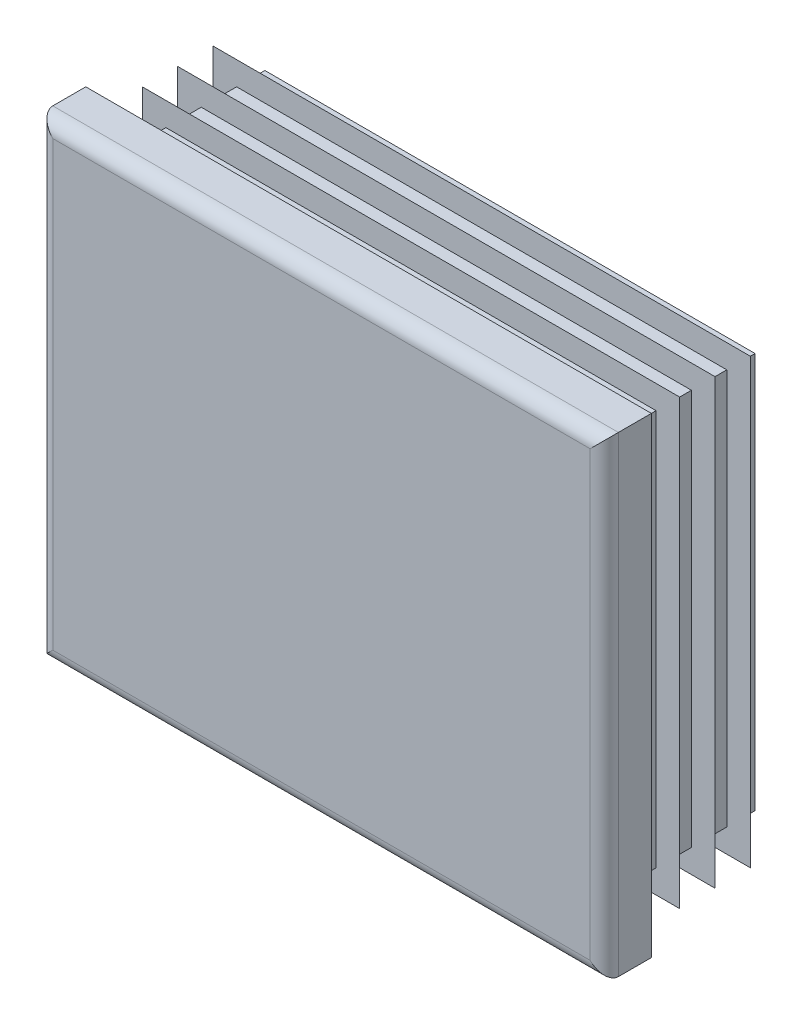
ISO-10303-21;
HEADER;
FILE_DESCRIPTION(('STEP AP214'),'2;1');
FILE_NAME('part.step','',(''),(''),'','','');
FILE_SCHEMA(('AUTOMOTIVE_DESIGN { 1 0 10303 214 1 1 1 1 }'));
ENDSEC;
DATA;
#1=APPLICATION_CONTEXT('core data for automotive mechanical design processes');
#2=APPLICATION_PROTOCOL_DEFINITION('international standard','automotive_design',2000,#1);
#3=PRODUCT_CONTEXT('',#1,'mechanical');
#4=PRODUCT('Part','Part','',(#3));
#5=PRODUCT_RELATED_PRODUCT_CATEGORY('part','',(#4));
#6=PRODUCT_DEFINITION_FORMATION('','',#4);
#7=PRODUCT_DEFINITION_CONTEXT('part definition',#1,'design');
#8=PRODUCT_DEFINITION('design','',#6,#7);
#9=PRODUCT_DEFINITION_SHAPE('','',#8);
#10=(LENGTH_UNIT() NAMED_UNIT(*) SI_UNIT(.MILLI.,.METRE.));
#11=(NAMED_UNIT(*) PLANE_ANGLE_UNIT() SI_UNIT($,.RADIAN.));
#12=(NAMED_UNIT(*) SI_UNIT($,.STERADIAN.) SOLID_ANGLE_UNIT());
#13=UNCERTAINTY_MEASURE_WITH_UNIT(LENGTH_MEASURE(1.E-05),#10,'distance_accuracy_value','');
#14=(GEOMETRIC_REPRESENTATION_CONTEXT(3) GLOBAL_UNCERTAINTY_ASSIGNED_CONTEXT((#13)) GLOBAL_UNIT_ASSIGNED_CONTEXT((#10,
#11,#12)) REPRESENTATION_CONTEXT('',''));
#15=CARTESIAN_POINT('',(0.,0.,0.));
#16=DIRECTION('',(0.,0.,1.));
#17=DIRECTION('',(1.,0.,0.));
#18=AXIS2_PLACEMENT_3D('',#15,#16,#17);
#19=CARTESIAN_POINT('',(28.5,-25.,5.));
#20=DIRECTION('',(0.,0.,-1.));
#21=DIRECTION('',(0.,1.,0.));
#22=AXIS2_PLACEMENT_3D('',#19,#20,#21);
#23=PLANE('',#22);
#24=DIRECTION('',(0.,1.,0.));
#25=VECTOR('',#24,1.);
#26=CARTESIAN_POINT('',(-28.5,-25.,5.));
#27=LINE('',#26,#25);
#28=CARTESIAN_POINT('',(-28.5,-23.5,5.));
#29=VERTEX_POINT('',#28);
#30=CARTESIAN_POINT('',(-28.5,23.5,5.));
#31=VERTEX_POINT('',#30);
#32=EDGE_CURVE('E310',#29,#31,#27,.T.);
#33=ORIENTED_EDGE('',*,*,#32,.F.);
#34=DIRECTION('',(-1.,0.,0.));
#35=VECTOR('',#34,1.);
#36=CARTESIAN_POINT('',(30.,-23.5,5.));
#37=LINE('',#36,#35);
#38=CARTESIAN_POINT('',(28.5,-23.5,5.));
#39=VERTEX_POINT('',#38);
#40=EDGE_CURVE('E482',#39,#29,#37,.T.);
#41=ORIENTED_EDGE('',*,*,#40,.F.);
#42=DIRECTION('',(0.,1.,0.));
#43=VECTOR('',#42,1.);
#44=CARTESIAN_POINT('',(28.5,-25.,5.));
#45=LINE('',#44,#43);
#46=CARTESIAN_POINT('',(28.5,23.5,5.));
#47=VERTEX_POINT('',#46);
#48=EDGE_CURVE('E305',#39,#47,#45,.T.);
#49=ORIENTED_EDGE('',*,*,#48,.T.);
#50=DIRECTION('',(-1.,0.,0.));
#51=VECTOR('',#50,1.);
#52=CARTESIAN_POINT('',(30.,23.5,5.));
#53=LINE('',#52,#51);
#54=EDGE_CURVE('E630',#47,#31,#53,.T.);
#55=ORIENTED_EDGE('',*,*,#54,.T.);
#56=EDGE_LOOP('',(#33,#41,#49,#55));
#57=FACE_BOUND('',#56,.T.);
#58=ADVANCED_FACE('F14',(#57),#23,.F.);
#59=CARTESIAN_POINT('',(-28.5,-25.,3.5));
#60=DIRECTION('',(0.,1.,0.));
#61=DIRECTION('',(-1.,0.,0.));
#62=AXIS2_PLACEMENT_3D('',#59,#60,#61);
#63=CYLINDRICAL_SURFACE('',#62,1.5);
#64=DIRECTION('',(0.,1.,0.));
#65=VECTOR('',#64,1.);
#66=CARTESIAN_POINT('',(-30.,-25.,3.5));
#67=LINE('',#66,#65);
#68=CARTESIAN_POINT('',(-30.,-25.,3.5));
#69=VERTEX_POINT('',#68);
#70=CARTESIAN_POINT('',(-30.,25.,3.5));
#71=VERTEX_POINT('',#70);
#72=EDGE_CURVE('E402',#69,#71,#67,.T.);
#73=ORIENTED_EDGE('',*,*,#72,.F.);
#74=CARTESIAN_POINT('',(-28.5,-23.5,3.5));
#75=DIRECTION('',(-0.707106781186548,0.707106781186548,0.));
#76=DIRECTION('',(0.707106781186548,0.707106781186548,0.));
#77=AXIS2_PLACEMENT_3D('',#74,#75,#76);
#78=ELLIPSE('',#77,2.12132034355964,1.5);
#79=EDGE_CURVE('E59',#69,#29,#78,.T.);
#80=ORIENTED_EDGE('',*,*,#79,.T.);
#81=ORIENTED_EDGE('',*,*,#32,.T.);
#82=CARTESIAN_POINT('',(-28.5,23.5,3.5));
#83=DIRECTION('',(0.707106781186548,0.707106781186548,0.));
#84=DIRECTION('',(-0.707106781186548,0.707106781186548,0.));
#85=AXIS2_PLACEMENT_3D('',#82,#83,#84);
#86=ELLIPSE('',#85,2.12132034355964,1.5);
#87=EDGE_CURVE('E306',#31,#71,#86,.F.);
#88=ORIENTED_EDGE('',*,*,#87,.T.);
#89=EDGE_LOOP('',(#73,#80,#81,#88));
#90=FACE_BOUND('',#89,.T.);
#91=ADVANCED_FACE('F16',(#90),#63,.T.);
#92=CARTESIAN_POINT('',(-30.,-25.,3.5));
#93=DIRECTION('',(1.,0.,0.));
#94=DIRECTION('',(0.,1.,0.));
#95=AXIS2_PLACEMENT_3D('',#92,#93,#94);
#96=PLANE('',#95);
#97=DIRECTION('',(0.,0.,-1.));
#98=VECTOR('',#97,1.);
#99=CARTESIAN_POINT('',(-30.,25.,3.5));
#100=LINE('',#99,#98);
#101=CARTESIAN_POINT('',(-30.,25.,0.));
#102=VERTEX_POINT('',#101);
#103=EDGE_CURVE('E615',#71,#102,#100,.T.);
#104=ORIENTED_EDGE('',*,*,#103,.T.);
#105=DIRECTION('',(0.,1.,0.));
#106=VECTOR('',#105,1.);
#107=CARTESIAN_POINT('',(-30.,-25.,0.));
#108=LINE('',#107,#106);
#109=CARTESIAN_POINT('',(-30.,-25.,0.));
#110=VERTEX_POINT('',#109);
#111=EDGE_CURVE('E400',#110,#102,#108,.T.);
#112=ORIENTED_EDGE('',*,*,#111,.F.);
#113=DIRECTION('',(0.,0.,-1.));
#114=VECTOR('',#113,1.);
#115=CARTESIAN_POINT('',(-30.,-25.,3.5));
#116=LINE('',#115,#114);
#117=EDGE_CURVE('E616',#69,#110,#116,.T.);
#118=ORIENTED_EDGE('',*,*,#117,.F.);
#119=ORIENTED_EDGE('',*,*,#72,.T.);
#120=EDGE_LOOP('',(#104,#112,#118,#119));
#121=FACE_BOUND('',#120,.T.);
#122=ADVANCED_FACE('F697',(#121),#96,.F.);
#123=CARTESIAN_POINT('',(-26.,-25.,0.));
#124=DIRECTION('',(1.,0.,0.));
#125=DIRECTION('',(0.,1.,0.));
#126=AXIS2_PLACEMENT_3D('',#123,#124,#125);
#127=PLANE('',#126);
#128=DIRECTION('',(0.,1.,0.));
#129=VECTOR('',#128,1.);
#130=CARTESIAN_POINT('',(-26.,-25.,0.));
#131=LINE('',#130,#129);
#132=CARTESIAN_POINT('',(-26.,-21.,0.));
#133=VERTEX_POINT('',#132);
#134=CARTESIAN_POINT('',(-26.,21.,0.));
#135=VERTEX_POINT('',#134);
#136=EDGE_CURVE('E397',#133,#135,#131,.T.);
#137=ORIENTED_EDGE('',*,*,#136,.T.);
#138=DIRECTION('',(0.,0.,-1.));
#139=VECTOR('',#138,1.);
#140=CARTESIAN_POINT('',(-26.,21.,0.));
#141=LINE('',#140,#139);
#142=CARTESIAN_POINT('',(-26.,21.,-0.75));
#143=VERTEX_POINT('',#142);
#144=EDGE_CURVE('E495',#135,#143,#141,.T.);
#145=ORIENTED_EDGE('',*,*,#144,.T.);
#146=DIRECTION('',(0.,1.,0.));
#147=VECTOR('',#146,1.);
#148=CARTESIAN_POINT('',(-26.,-25.,-0.75));
#149=LINE('',#148,#147);
#150=CARTESIAN_POINT('',(-26.,-21.,-0.75));
#151=VERTEX_POINT('',#150);
#152=EDGE_CURVE('E394',#151,#143,#149,.T.);
#153=ORIENTED_EDGE('',*,*,#152,.F.);
#154=DIRECTION('',(0.,0.,1.));
#155=VECTOR('',#154,1.);
#156=CARTESIAN_POINT('',(-26.,-21.,0.));
#157=LINE('',#156,#155);
#158=EDGE_CURVE('E489',#151,#133,#157,.T.);
#159=ORIENTED_EDGE('',*,*,#158,.T.);
#160=EDGE_LOOP('',(#137,#145,#153,#159));
#161=FACE_BOUND('',#160,.T.);
#162=ADVANCED_FACE('F787',(#161),#127,.F.);
#163=CARTESIAN_POINT('',(-28.5,-25.,-0.75));
#164=DIRECTION('',(0.342020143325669,0.,0.939692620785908));
#165=DIRECTION('',(-0.939692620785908,0.,0.342020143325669));
#166=AXIS2_PLACEMENT_3D('',#163,#164,#165);
#167=PLANE('',#166);
#168=DIRECTION('',(0.,1.,0.));
#169=VECTOR('',#168,1.);
#170=CARTESIAN_POINT('',(-28.5,-25.,-0.75));
#171=LINE('',#170,#169);
#172=CARTESIAN_POINT('',(-28.5,-23.5,-0.75));
#173=VERTEX_POINT('',#172);
#174=CARTESIAN_POINT('',(-28.5,23.5,-0.75));
#175=VERTEX_POINT('',#174);
#176=EDGE_CURVE('E392',#173,#175,#171,.T.);
#177=ORIENTED_EDGE('',*,*,#176,.T.);
#178=DIRECTION('',(0.844349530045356,-0.438895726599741,-0.307318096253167));
#179=VECTOR('',#178,1.);
#180=CARTESIAN_POINT('',(-10.5268020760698,14.1574712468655,-7.29170905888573));
#181=LINE('',#180,#179);
#182=CARTESIAN_POINT('',(-26.,22.2004915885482,-1.65992558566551));
#183=VERTEX_POINT('',#182);
#184=EDGE_CURVE('E519',#175,#183,#181,.T.);
#185=ORIENTED_EDGE('',*,*,#184,.T.);
#186=DIRECTION('',(0.,1.,0.));
#187=VECTOR('',#186,1.);
#188=CARTESIAN_POINT('',(-26.,-25.,-1.65992558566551));
#189=LINE('',#188,#187);
#190=CARTESIAN_POINT('',(-26.,-22.2004915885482,-1.65992558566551));
#191=VERTEX_POINT('',#190);
#192=EDGE_CURVE('E389',#191,#183,#189,.T.);
#193=ORIENTED_EDGE('',*,*,#192,.F.);
#194=DIRECTION('',(-0.844349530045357,-0.438895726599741,0.307318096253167));
#195=VECTOR('',#194,1.);
#196=CARTESIAN_POINT('',(-29.0558721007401,-23.7889441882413,-0.547679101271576));
#197=LINE('',#196,#195);
#198=EDGE_CURVE('E507',#191,#173,#197,.T.);
#199=ORIENTED_EDGE('',*,*,#198,.T.);
#200=EDGE_LOOP('',(#177,#185,#193,#199));
#201=FACE_BOUND('',#200,.T.);
#202=ADVANCED_FACE('F783',(#201),#167,.F.);
#203=CARTESIAN_POINT('',(-26.,-25.,-1.65992558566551));
#204=DIRECTION('',(1.,0.,0.));
#205=DIRECTION('',(0.,1.,0.));
#206=AXIS2_PLACEMENT_3D('',#203,#204,#205);
#207=PLANE('',#206);
#208=ORIENTED_EDGE('',*,*,#192,.T.);
#209=DIRECTION('',(0.,-0.819152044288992,-0.573576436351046));
#210=VECTOR('',#209,1.);
#211=CARTESIAN_POINT('',(-26.,-9.47151365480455,-23.8369024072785));
#212=LINE('',#211,#210);
#213=CARTESIAN_POINT('',(-26.,21.,-2.50051884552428));
#214=VERTEX_POINT('',#213);
#215=EDGE_CURVE('E516',#183,#214,#212,.T.);
#216=ORIENTED_EDGE('',*,*,#215,.T.);
#217=DIRECTION('',(0.,0.,-1.));
#218=VECTOR('',#217,1.);
#219=CARTESIAN_POINT('',(-26.,21.,-1.65992558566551));
#220=LINE('',#219,#218);
#221=CARTESIAN_POINT('',(-26.,21.,-4.5));
#222=VERTEX_POINT('',#221);
#223=EDGE_CURVE('E525',#214,#222,#220,.T.);
#224=ORIENTED_EDGE('',*,*,#223,.T.);
#225=DIRECTION('',(0.,1.,0.));
#226=VECTOR('',#225,1.);
#227=CARTESIAN_POINT('',(-26.,-25.,-4.5));
#228=LINE('',#227,#226);
#229=CARTESIAN_POINT('',(-26.,-21.,-4.5));
#230=VERTEX_POINT('',#229);
#231=EDGE_CURVE('E386',#230,#222,#228,.T.);
#232=ORIENTED_EDGE('',*,*,#231,.F.);
#233=DIRECTION('',(0.,0.,1.));
#234=VECTOR('',#233,1.);
#235=CARTESIAN_POINT('',(-26.,-21.,-1.65992558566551));
#236=LINE('',#235,#234);
#237=CARTESIAN_POINT('',(-26.,-21.,-2.50051884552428));
#238=VERTEX_POINT('',#237);
#239=EDGE_CURVE('E522',#230,#238,#236,.T.);
#240=ORIENTED_EDGE('',*,*,#239,.T.);
#241=DIRECTION('',(0.,-0.819152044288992,0.573576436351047));
#242=VECTOR('',#241,1.);
#243=CARTESIAN_POINT('',(-26.,-24.0789899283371,-0.344586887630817));
#244=LINE('',#243,#242);
#245=EDGE_CURVE('E504',#238,#191,#244,.T.);
#246=ORIENTED_EDGE('',*,*,#245,.T.);
#247=EDGE_LOOP('',(#208,#216,#224,#232,#240,#246));
#248=FACE_BOUND('',#247,.T.);
#249=ADVANCED_FACE('F779',(#248),#207,.F.);
#250=CARTESIAN_POINT('',(-28.5,-25.,-4.5));
#251=DIRECTION('',(0.342020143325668,0.,0.939692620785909));
#252=DIRECTION('',(-0.939692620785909,0.,0.342020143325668));
#253=AXIS2_PLACEMENT_3D('',#250,#251,#252);
#254=PLANE('',#253);
#255=DIRECTION('',(0.,1.,0.));
#256=VECTOR('',#255,1.);
#257=CARTESIAN_POINT('',(-28.5,-25.,-4.5));
#258=LINE('',#257,#256);
#259=CARTESIAN_POINT('',(-28.5,-23.5,-4.5));
#260=VERTEX_POINT('',#259);
#261=CARTESIAN_POINT('',(-28.5,23.5,-4.5));
#262=VERTEX_POINT('',#261);
#263=EDGE_CURVE('E384',#260,#262,#258,.T.);
#264=ORIENTED_EDGE('',*,*,#263,.T.);
#265=DIRECTION('',(0.844349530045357,-0.43889572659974,-0.307318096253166));
#266=VECTOR('',#265,1.);
#267=CARTESIAN_POINT('',(-10.5268020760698,14.1574712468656,-11.0417090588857));
#268=LINE('',#267,#266);
#269=CARTESIAN_POINT('',(-26.,22.2004915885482,-5.40992558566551));
#270=VERTEX_POINT('',#269);
#271=EDGE_CURVE('E549',#262,#270,#268,.T.);
#272=ORIENTED_EDGE('',*,*,#271,.T.);
#273=DIRECTION('',(0.,1.,0.));
#274=VECTOR('',#273,1.);
#275=CARTESIAN_POINT('',(-26.,-25.,-5.4099255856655));
#276=LINE('',#275,#274);
#277=CARTESIAN_POINT('',(-26.,-22.2004915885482,-5.40992558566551));
#278=VERTEX_POINT('',#277);
#279=EDGE_CURVE('E381',#278,#270,#276,.T.);
#280=ORIENTED_EDGE('',*,*,#279,.F.);
#281=DIRECTION('',(-0.844349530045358,-0.438895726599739,0.307318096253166));
#282=VECTOR('',#281,1.);
#283=CARTESIAN_POINT('',(-29.0558721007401,-23.7889441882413,-4.29767910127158));
#284=LINE('',#283,#282);
#285=EDGE_CURVE('E537',#278,#260,#284,.T.);
#286=ORIENTED_EDGE('',*,*,#285,.T.);
#287=EDGE_LOOP('',(#264,#272,#280,#286));
#288=FACE_BOUND('',#287,.T.);
#289=ADVANCED_FACE('F775',(#288),#254,.F.);
#290=CARTESIAN_POINT('',(-26.,-25.,-5.4099255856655));
#291=DIRECTION('',(1.,0.,0.));
#292=DIRECTION('',(0.,1.,0.));
#293=AXIS2_PLACEMENT_3D('',#290,#291,#292);
#294=PLANE('',#293);
#295=ORIENTED_EDGE('',*,*,#279,.T.);
#296=DIRECTION('',(0.,-0.819152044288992,-0.573576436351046));
#297=VECTOR('',#296,1.);
#298=CARTESIAN_POINT('',(-26.,-9.47151365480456,-27.5869024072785));
#299=LINE('',#298,#297);
#300=CARTESIAN_POINT('',(-26.,21.,-6.25051884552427));
#301=VERTEX_POINT('',#300);
#302=EDGE_CURVE('E546',#270,#301,#299,.T.);
#303=ORIENTED_EDGE('',*,*,#302,.T.);
#304=DIRECTION('',(0.,0.,-1.));
#305=VECTOR('',#304,1.);
#306=CARTESIAN_POINT('',(-26.,21.,-5.4099255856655));
#307=LINE('',#306,#305);
#308=CARTESIAN_POINT('',(-26.,21.,-8.25));
#309=VERTEX_POINT('',#308);
#310=EDGE_CURVE('E555',#301,#309,#307,.T.);
#311=ORIENTED_EDGE('',*,*,#310,.T.);
#312=DIRECTION('',(0.,1.,0.));
#313=VECTOR('',#312,1.);
#314=CARTESIAN_POINT('',(-26.,-25.,-8.25));
#315=LINE('',#314,#313);
#316=CARTESIAN_POINT('',(-26.,-21.,-8.25));
#317=VERTEX_POINT('',#316);
#318=EDGE_CURVE('E378',#317,#309,#315,.T.);
#319=ORIENTED_EDGE('',*,*,#318,.F.);
#320=DIRECTION('',(0.,0.,1.));
#321=VECTOR('',#320,1.);
#322=CARTESIAN_POINT('',(-26.,-21.,-5.4099255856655));
#323=LINE('',#322,#321);
#324=CARTESIAN_POINT('',(-26.,-21.,-6.25051884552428));
#325=VERTEX_POINT('',#324);
#326=EDGE_CURVE('E552',#317,#325,#323,.T.);
#327=ORIENTED_EDGE('',*,*,#326,.T.);
#328=DIRECTION('',(0.,-0.819152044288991,0.573576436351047));
#329=VECTOR('',#328,1.);
#330=CARTESIAN_POINT('',(-26.,-24.0789899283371,-4.09458688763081));
#331=LINE('',#330,#329);
#332=EDGE_CURVE('E534',#325,#278,#331,.T.);
#333=ORIENTED_EDGE('',*,*,#332,.T.);
#334=EDGE_LOOP('',(#295,#303,#311,#319,#327,#333));
#335=FACE_BOUND('',#334,.T.);
#336=ADVANCED_FACE('F771',(#335),#294,.F.);
#337=CARTESIAN_POINT('',(-28.5,-25.,-8.25));
#338=DIRECTION('',(0.342020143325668,0.,0.939692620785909));
#339=DIRECTION('',(-0.939692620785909,0.,0.342020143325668));
#340=AXIS2_PLACEMENT_3D('',#337,#338,#339);
#341=PLANE('',#340);
#342=DIRECTION('',(0.,1.,0.));
#343=VECTOR('',#342,1.);
#344=CARTESIAN_POINT('',(-28.5,-25.,-8.25));
#345=LINE('',#344,#343);
#346=CARTESIAN_POINT('',(-28.5,-23.5,-8.25));
#347=VERTEX_POINT('',#346);
#348=CARTESIAN_POINT('',(-28.5,23.5,-8.25));
#349=VERTEX_POINT('',#348);
#350=EDGE_CURVE('E376',#347,#349,#345,.T.);
#351=ORIENTED_EDGE('',*,*,#350,.T.);
#352=DIRECTION('',(0.844349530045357,-0.43889572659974,-0.307318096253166));
#353=VECTOR('',#352,1.);
#354=CARTESIAN_POINT('',(-10.5268020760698,14.1574712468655,-14.7917090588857));
#355=LINE('',#354,#353);
#356=CARTESIAN_POINT('',(-26.,22.2004915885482,-9.15992558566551));
#357=VERTEX_POINT('',#356);
#358=EDGE_CURVE('E579',#349,#357,#355,.T.);
#359=ORIENTED_EDGE('',*,*,#358,.T.);
#360=DIRECTION('',(0.,1.,0.));
#361=VECTOR('',#360,1.);
#362=CARTESIAN_POINT('',(-26.,-25.,-9.1599255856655));
#363=LINE('',#362,#361);
#364=CARTESIAN_POINT('',(-26.,-22.2004915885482,-9.1599255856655));
#365=VERTEX_POINT('',#364);
#366=EDGE_CURVE('E373',#365,#357,#363,.T.);
#367=ORIENTED_EDGE('',*,*,#366,.F.);
#368=DIRECTION('',(-0.844349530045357,-0.43889572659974,0.307318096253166));
#369=VECTOR('',#368,1.);
#370=CARTESIAN_POINT('',(-29.0558721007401,-23.7889441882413,-8.04767910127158));
#371=LINE('',#370,#369);
#372=EDGE_CURVE('E567',#365,#347,#371,.T.);
#373=ORIENTED_EDGE('',*,*,#372,.T.);
#374=EDGE_LOOP('',(#351,#359,#367,#373));
#375=FACE_BOUND('',#374,.T.);
#376=ADVANCED_FACE('F767',(#375),#341,.F.);
#377=CARTESIAN_POINT('',(-26.,-25.,-9.1599255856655));
#378=DIRECTION('',(1.,0.,0.));
#379=DIRECTION('',(0.,1.,0.));
#380=AXIS2_PLACEMENT_3D('',#377,#378,#379);
#381=PLANE('',#380);
#382=ORIENTED_EDGE('',*,*,#366,.T.);
#383=DIRECTION('',(0.,-0.819152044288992,-0.573576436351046));
#384=VECTOR('',#383,1.);
#385=CARTESIAN_POINT('',(-26.,-9.47151365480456,-31.3369024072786));
#386=LINE('',#385,#384);
#387=CARTESIAN_POINT('',(-26.,21.,-10.0005188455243));
#388=VERTEX_POINT('',#387);
#389=EDGE_CURVE('E576',#357,#388,#386,.T.);
#390=ORIENTED_EDGE('',*,*,#389,.T.);
#391=DIRECTION('',(0.,0.,-1.));
#392=VECTOR('',#391,1.);
#393=CARTESIAN_POINT('',(-26.,21.,-9.1599255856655));
#394=LINE('',#393,#392);
#395=CARTESIAN_POINT('',(-26.,21.,-12.));
#396=VERTEX_POINT('',#395);
#397=EDGE_CURVE('E585',#388,#396,#394,.T.);
#398=ORIENTED_EDGE('',*,*,#397,.T.);
#399=DIRECTION('',(0.,1.,0.));
#400=VECTOR('',#399,1.);
#401=CARTESIAN_POINT('',(-26.,-25.,-12.));
#402=LINE('',#401,#400);
#403=CARTESIAN_POINT('',(-26.,-21.,-12.));
#404=VERTEX_POINT('',#403);
#405=EDGE_CURVE('E370',#404,#396,#402,.T.);
#406=ORIENTED_EDGE('',*,*,#405,.F.);
#407=DIRECTION('',(0.,0.,1.));
#408=VECTOR('',#407,1.);
#409=CARTESIAN_POINT('',(-26.,-21.,-9.1599255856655));
#410=LINE('',#409,#408);
#411=CARTESIAN_POINT('',(-26.,-21.,-10.0005188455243));
#412=VERTEX_POINT('',#411);
#413=EDGE_CURVE('E582',#404,#412,#410,.T.);
#414=ORIENTED_EDGE('',*,*,#413,.T.);
#415=DIRECTION('',(0.,-0.819152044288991,0.573576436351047));
#416=VECTOR('',#415,1.);
#417=CARTESIAN_POINT('',(-26.,-24.0789899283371,-7.84458688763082));
#418=LINE('',#417,#416);
#419=EDGE_CURVE('E564',#412,#365,#418,.T.);
#420=ORIENTED_EDGE('',*,*,#419,.T.);
#421=EDGE_LOOP('',(#382,#390,#398,#406,#414,#420));
#422=FACE_BOUND('',#421,.T.);
#423=ADVANCED_FACE('F764',(#422),#381,.F.);
#424=CARTESIAN_POINT('',(-28.5,-25.,-12.));
#425=DIRECTION('',(0.342020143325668,0.,0.939692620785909));
#426=DIRECTION('',(-0.939692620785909,0.,0.342020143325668));
#427=AXIS2_PLACEMENT_3D('',#424,#425,#426);
#428=PLANE('',#427);
#429=DIRECTION('',(0.,1.,0.));
#430=VECTOR('',#429,1.);
#431=CARTESIAN_POINT('',(-28.5,-25.,-12.));
#432=LINE('',#431,#430);
#433=CARTESIAN_POINT('',(-28.5,-23.5,-12.));
#434=VERTEX_POINT('',#433);
#435=CARTESIAN_POINT('',(-28.5,23.5,-12.));
#436=VERTEX_POINT('',#435);
#437=EDGE_CURVE('E368',#434,#436,#432,.T.);
#438=ORIENTED_EDGE('',*,*,#437,.T.);
#439=DIRECTION('',(0.844349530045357,-0.43889572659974,-0.307318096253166));
#440=VECTOR('',#439,1.);
#441=CARTESIAN_POINT('',(-10.5268020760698,14.1574712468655,-18.5417090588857));
#442=LINE('',#441,#440);
#443=CARTESIAN_POINT('',(-26.,22.2004915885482,-12.9099255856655));
#444=VERTEX_POINT('',#443);
#445=EDGE_CURVE('E607',#436,#444,#442,.T.);
#446=ORIENTED_EDGE('',*,*,#445,.T.);
#447=DIRECTION('',(0.,1.,0.));
#448=VECTOR('',#447,1.);
#449=CARTESIAN_POINT('',(-26.,-25.,-12.9099255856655));
#450=LINE('',#449,#448);
#451=CARTESIAN_POINT('',(-26.,-22.2004915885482,-12.9099255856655));
#452=VERTEX_POINT('',#451);
#453=EDGE_CURVE('E365',#452,#444,#450,.T.);
#454=ORIENTED_EDGE('',*,*,#453,.F.);
#455=DIRECTION('',(-0.844349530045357,-0.438895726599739,0.307318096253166));
#456=VECTOR('',#455,1.);
#457=CARTESIAN_POINT('',(-29.0558721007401,-23.7889441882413,-11.7976791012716));
#458=LINE('',#457,#456);
#459=EDGE_CURVE('E595',#452,#434,#458,.T.);
#460=ORIENTED_EDGE('',*,*,#459,.T.);
#461=EDGE_LOOP('',(#438,#446,#454,#460));
#462=FACE_BOUND('',#461,.T.);
#463=ADVANCED_FACE('F675',(#462),#428,.F.);
#464=CARTESIAN_POINT('',(-26.,-25.,-12.9099255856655));
#465=DIRECTION('',(1.,0.,0.));
#466=DIRECTION('',(0.,1.,0.));
#467=AXIS2_PLACEMENT_3D('',#464,#465,#466);
#468=PLANE('',#467);
#469=ORIENTED_EDGE('',*,*,#453,.T.);
#470=DIRECTION('',(0.,-0.819152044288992,-0.573576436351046));
#471=VECTOR('',#470,1.);
#472=CARTESIAN_POINT('',(-26.,-9.47151365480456,-35.0869024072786));
#473=LINE('',#472,#471);
#474=CARTESIAN_POINT('',(-26.,21.,-13.7505188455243));
#475=VERTEX_POINT('',#474);
#476=EDGE_CURVE('E604',#444,#475,#473,.T.);
#477=ORIENTED_EDGE('',*,*,#476,.T.);
#478=DIRECTION('',(0.,0.,-1.));
#479=VECTOR('',#478,1.);
#480=CARTESIAN_POINT('',(-26.,21.,-12.9099255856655));
#481=LINE('',#480,#479);
#482=CARTESIAN_POINT('',(-26.,21.,-15.));
#483=VERTEX_POINT('',#482);
#484=EDGE_CURVE('E613',#475,#483,#481,.T.);
#485=ORIENTED_EDGE('',*,*,#484,.T.);
#486=DIRECTION('',(0.,1.,0.));
#487=VECTOR('',#486,1.);
#488=CARTESIAN_POINT('',(-26.,-25.,-15.));
#489=LINE('',#488,#487);
#490=CARTESIAN_POINT('',(-26.,-21.,-15.));
#491=VERTEX_POINT('',#490);
#492=EDGE_CURVE('E362',#491,#483,#489,.T.);
#493=ORIENTED_EDGE('',*,*,#492,.F.);
#494=DIRECTION('',(0.,0.,1.));
#495=VECTOR('',#494,1.);
#496=CARTESIAN_POINT('',(-26.,-21.,-12.9099255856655));
#497=LINE('',#496,#495);
#498=CARTESIAN_POINT('',(-26.,-21.,-13.7505188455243));
#499=VERTEX_POINT('',#498);
#500=EDGE_CURVE('E610',#491,#499,#497,.T.);
#501=ORIENTED_EDGE('',*,*,#500,.T.);
#502=DIRECTION('',(0.,-0.819152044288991,0.573576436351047));
#503=VECTOR('',#502,1.);
#504=CARTESIAN_POINT('',(-26.,-24.0789899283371,-11.5945868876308));
#505=LINE('',#504,#503);
#506=EDGE_CURVE('E592',#499,#452,#505,.T.);
#507=ORIENTED_EDGE('',*,*,#506,.T.);
#508=EDGE_LOOP('',(#469,#477,#485,#493,#501,#507));
#509=FACE_BOUND('',#508,.T.);
#510=ADVANCED_FACE('F677',(#509),#468,.F.);
#511=CARTESIAN_POINT('',(-26.,-25.,-15.));
#512=DIRECTION('',(0.,0.,1.));
#513=DIRECTION('',(0.,-1.,0.));
#514=AXIS2_PLACEMENT_3D('',#511,#512,#513);
#515=PLANE('',#514);
#516=ORIENTED_EDGE('',*,*,#492,.T.);
#517=DIRECTION('',(-1.,0.,0.));
#518=VECTOR('',#517,1.);
#519=CARTESIAN_POINT('',(30.,21.,-15.));
#520=LINE('',#519,#518);
#521=CARTESIAN_POINT('',(26.,21.,-15.));
#522=VERTEX_POINT('',#521);
#523=EDGE_CURVE('E438',#522,#483,#520,.T.);
#524=ORIENTED_EDGE('',*,*,#523,.F.);
#525=DIRECTION('',(0.,1.,0.));
#526=VECTOR('',#525,1.);
#527=CARTESIAN_POINT('',(26.,-25.,-15.));
#528=LINE('',#527,#526);
#529=CARTESIAN_POINT('',(26.,-21.,-15.));
#530=VERTEX_POINT('',#529);
#531=EDGE_CURVE('E359',#530,#522,#528,.T.);
#532=ORIENTED_EDGE('',*,*,#531,.F.);
#533=DIRECTION('',(-1.,0.,0.));
#534=VECTOR('',#533,1.);
#535=CARTESIAN_POINT('',(30.,-21.,-15.));
#536=LINE('',#535,#534);
#537=EDGE_CURVE('E436',#530,#491,#536,.T.);
#538=ORIENTED_EDGE('',*,*,#537,.T.);
#539=EDGE_LOOP('',(#516,#524,#532,#538));
#540=FACE_BOUND('',#539,.T.);
#541=ADVANCED_FACE('F435',(#540),#515,.F.);
#542=CARTESIAN_POINT('',(26.,-25.,-15.));
#543=DIRECTION('',(-1.,0.,0.));
#544=DIRECTION('',(0.,-1.,0.));
#545=AXIS2_PLACEMENT_3D('',#542,#543,#544);
#546=PLANE('',#545);
#547=DIRECTION('',(0.,0.,1.));
#548=VECTOR('',#547,1.);
#549=CARTESIAN_POINT('',(26.,21.,-15.));
#550=LINE('',#549,#548);
#551=CARTESIAN_POINT('',(26.,21.,-13.7505188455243));
#552=VERTEX_POINT('',#551);
#553=EDGE_CURVE('E9',#522,#552,#550,.T.);
#554=ORIENTED_EDGE('',*,*,#553,.T.);
#555=DIRECTION('',(0.,0.819152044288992,0.573576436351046));
#556=VECTOR('',#555,1.);
#557=CARTESIAN_POINT('',(26.,-10.4535274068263,-35.7745158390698));
#558=LINE('',#557,#556);
#559=CARTESIAN_POINT('',(26.,22.2004915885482,-12.9099255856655));
#560=VERTEX_POINT('',#559);
#561=EDGE_CURVE('E601',#552,#560,#558,.T.);
#562=ORIENTED_EDGE('',*,*,#561,.T.);
#563=DIRECTION('',(0.,1.,0.));
#564=VECTOR('',#563,1.);
#565=CARTESIAN_POINT('',(26.,-25.,-12.9099255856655));
#566=LINE('',#565,#564);
#567=CARTESIAN_POINT('',(26.,-22.2004915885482,-12.9099255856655));
#568=VERTEX_POINT('',#567);
#569=EDGE_CURVE('E356',#568,#560,#566,.T.);
#570=ORIENTED_EDGE('',*,*,#569,.F.);
#571=DIRECTION('',(0.,0.819152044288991,-0.573576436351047));
#572=VECTOR('',#571,1.);
#573=CARTESIAN_POINT('',(26.,-23.0969761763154,-12.2822003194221));
#574=LINE('',#573,#572);
#575=CARTESIAN_POINT('',(26.,-21.,-13.7505188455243));
#576=VERTEX_POINT('',#575);
#577=EDGE_CURVE('E428',#568,#576,#574,.T.);
#578=ORIENTED_EDGE('',*,*,#577,.T.);
#579=DIRECTION('',(0.,0.,-1.));
#580=VECTOR('',#579,1.);
#581=CARTESIAN_POINT('',(26.,-21.,-15.));
#582=LINE('',#581,#580);
#583=EDGE_CURVE('E23',#576,#530,#582,.T.);
#584=ORIENTED_EDGE('',*,*,#583,.T.);
#585=ORIENTED_EDGE('',*,*,#531,.T.);
#586=EDGE_LOOP('',(#554,#562,#570,#578,#584,#585));
#587=FACE_BOUND('',#586,.T.);
#588=ADVANCED_FACE('F426',(#587),#546,.F.);
#589=CARTESIAN_POINT('',(26.,-25.,-12.9099255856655));
#590=DIRECTION('',(-0.342020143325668,0.,0.939692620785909));
#591=DIRECTION('',(-0.939692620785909,0.,-0.342020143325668));
#592=AXIS2_PLACEMENT_3D('',#589,#590,#591);
#593=PLANE('',#592);
#594=ORIENTED_EDGE('',*,*,#569,.T.);
#595=DIRECTION('',(0.844349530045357,0.43889572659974,0.307318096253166));
#596=VECTOR('',#595,1.);
#597=CARTESIAN_POINT('',(8.50837572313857,13.1082864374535,-19.2763561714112));
#598=LINE('',#597,#596);
#599=CARTESIAN_POINT('',(28.5,23.5,-12.));
#600=VERTEX_POINT('',#599);
#601=EDGE_CURVE('E598',#560,#600,#598,.T.);
#602=ORIENTED_EDGE('',*,*,#601,.T.);
#603=DIRECTION('',(0.,1.,0.));
#604=VECTOR('',#603,1.);
#605=CARTESIAN_POINT('',(28.5,-25.,-12.));
#606=LINE('',#605,#604);
#607=CARTESIAN_POINT('',(28.5,-23.5,-12.));
#608=VERTEX_POINT('',#607);
#609=EDGE_CURVE('E353',#608,#600,#606,.T.);
#610=ORIENTED_EDGE('',*,*,#609,.F.);
#611=DIRECTION('',(-0.844349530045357,0.438895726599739,-0.307318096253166));
#612=VECTOR('',#611,1.);
#613=CARTESIAN_POINT('',(27.0374457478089,-22.7397593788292,-12.532326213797));
#614=LINE('',#613,#612);
#615=EDGE_CURVE('E588',#608,#568,#614,.T.);
#616=ORIENTED_EDGE('',*,*,#615,.T.);
#617=EDGE_LOOP('',(#594,#602,#610,#616));
#618=FACE_BOUND('',#617,.T.);
#619=ADVANCED_FACE('F752',(#618),#593,.F.);
#620=CARTESIAN_POINT('',(28.5,-25.,-12.));
#621=DIRECTION('',(0.,0.,-1.));
#622=DIRECTION('',(0.,1.,0.));
#623=AXIS2_PLACEMENT_3D('',#620,#621,#622);
#624=PLANE('',#623);
#625=ORIENTED_EDGE('',*,*,#609,.T.);
#626=DIRECTION('',(-1.,0.,0.));
#627=VECTOR('',#626,1.);
#628=CARTESIAN_POINT('',(30.,23.5,-12.));
#629=LINE('',#628,#627);
#630=EDGE_CURVE('E444',#600,#436,#629,.T.);
#631=ORIENTED_EDGE('',*,*,#630,.T.);
#632=ORIENTED_EDGE('',*,*,#437,.F.);
#633=DIRECTION('',(-1.,0.,0.));
#634=VECTOR('',#633,1.);
#635=CARTESIAN_POINT('',(30.,-23.5,-12.));
#636=LINE('',#635,#634);
#637=EDGE_CURVE('E451',#608,#434,#636,.T.);
#638=ORIENTED_EDGE('',*,*,#637,.F.);
#639=EDGE_LOOP('',(#625,#631,#632,#638));
#640=FACE_BOUND('',#639,.T.);
#641=ORIENTED_EDGE('',*,*,#405,.T.);
#642=DIRECTION('',(-1.,0.,0.));
#643=VECTOR('',#642,1.);
#644=CARTESIAN_POINT('',(30.,21.,-12.));
#645=LINE('',#644,#643);
#646=CARTESIAN_POINT('',(26.,21.,-12.));
#647=VERTEX_POINT('',#646);
#648=EDGE_CURVE('E663',#647,#396,#645,.T.);
#649=ORIENTED_EDGE('',*,*,#648,.F.);
#650=DIRECTION('',(0.,1.,0.));
#651=VECTOR('',#650,1.);
#652=CARTESIAN_POINT('',(26.,-25.,-12.));
#653=LINE('',#652,#651);
#654=CARTESIAN_POINT('',(26.,-21.,-12.));
#655=VERTEX_POINT('',#654);
#656=EDGE_CURVE('E350',#655,#647,#653,.T.);
#657=ORIENTED_EDGE('',*,*,#656,.F.);
#658=DIRECTION('',(-1.,0.,0.));
#659=VECTOR('',#658,1.);
#660=CARTESIAN_POINT('',(30.,-21.,-12.));
#661=LINE('',#660,#659);
#662=EDGE_CURVE('E453',#655,#404,#661,.T.);
#663=ORIENTED_EDGE('',*,*,#662,.T.);
#664=EDGE_LOOP('',(#641,#649,#657,#663));
#665=FACE_BOUND('',#664,.T.);
#666=ADVANCED_FACE('F667',(#640,#665),#624,.F.);
#667=CARTESIAN_POINT('',(26.,-25.,-12.));
#668=DIRECTION('',(-1.,0.,0.));
#669=DIRECTION('',(0.,-1.,0.));
#670=AXIS2_PLACEMENT_3D('',#667,#668,#669);
#671=PLANE('',#670);
#672=DIRECTION('',(0.,0.,1.));
#673=VECTOR('',#672,1.);
#674=CARTESIAN_POINT('',(26.,21.,-12.));
#675=LINE('',#674,#673);
#676=CARTESIAN_POINT('',(26.,21.,-10.0005188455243));
#677=VERTEX_POINT('',#676);
#678=EDGE_CURVE('E420',#647,#677,#675,.T.);
#679=ORIENTED_EDGE('',*,*,#678,.T.);
#680=DIRECTION('',(0.,0.819152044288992,0.573576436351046));
#681=VECTOR('',#680,1.);
#682=CARTESIAN_POINT('',(26.,-10.805912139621,-32.2712582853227));
#683=LINE('',#682,#681);
#684=CARTESIAN_POINT('',(26.,22.2004915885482,-9.1599255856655));
#685=VERTEX_POINT('',#684);
#686=EDGE_CURVE('E573',#677,#685,#683,.T.);
#687=ORIENTED_EDGE('',*,*,#686,.T.);
#688=DIRECTION('',(0.,1.,0.));
#689=VECTOR('',#688,1.);
#690=CARTESIAN_POINT('',(26.,-25.,-9.1599255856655));
#691=LINE('',#690,#689);
#692=CARTESIAN_POINT('',(26.,-22.2004915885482,-9.1599255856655));
#693=VERTEX_POINT('',#692);
#694=EDGE_CURVE('E347',#693,#685,#691,.T.);
#695=ORIENTED_EDGE('',*,*,#694,.F.);
#696=DIRECTION('',(0.,0.819152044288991,-0.573576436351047));
#697=VECTOR('',#696,1.);
#698=CARTESIAN_POINT('',(26.,-22.7445914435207,-8.77894276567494));
#699=LINE('',#698,#697);
#700=CARTESIAN_POINT('',(26.,-21.,-10.0005188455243));
#701=VERTEX_POINT('',#700);
#702=EDGE_CURVE('E561',#693,#701,#699,.T.);
#703=ORIENTED_EDGE('',*,*,#702,.T.);
#704=DIRECTION('',(0.,0.,-1.));
#705=VECTOR('',#704,1.);
#706=CARTESIAN_POINT('',(26.,-21.,-12.));
#707=LINE('',#706,#705);
#708=EDGE_CURVE('E417',#701,#655,#707,.T.);
#709=ORIENTED_EDGE('',*,*,#708,.T.);
#710=ORIENTED_EDGE('',*,*,#656,.T.);
#711=EDGE_LOOP('',(#679,#687,#695,#703,#709,#710));
#712=FACE_BOUND('',#711,.T.);
#713=ADVANCED_FACE('F745',(#712),#671,.F.);
#714=CARTESIAN_POINT('',(26.,-25.,-9.1599255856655));
#715=DIRECTION('',(-0.342020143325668,0.,0.939692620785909));
#716=DIRECTION('',(-0.939692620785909,0.,-0.342020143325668));
#717=AXIS2_PLACEMENT_3D('',#714,#715,#716);
#718=PLANE('',#717);
#719=ORIENTED_EDGE('',*,*,#694,.T.);
#720=DIRECTION('',(0.844349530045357,0.43889572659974,0.307318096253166));
#721=VECTOR('',#720,1.);
#722=CARTESIAN_POINT('',(8.50837572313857,13.1082864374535,-15.5263561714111));
#723=LINE('',#722,#721);
#724=CARTESIAN_POINT('',(28.5,23.5,-8.25));
#725=VERTEX_POINT('',#724);
#726=EDGE_CURVE('E570',#685,#725,#723,.T.);
#727=ORIENTED_EDGE('',*,*,#726,.T.);
#728=DIRECTION('',(0.,1.,0.));
#729=VECTOR('',#728,1.);
#730=CARTESIAN_POINT('',(28.5,-25.,-8.25));
#731=LINE('',#730,#729);
#732=CARTESIAN_POINT('',(28.5,-23.5,-8.25));
#733=VERTEX_POINT('',#732);
#734=EDGE_CURVE('E344',#733,#725,#731,.T.);
#735=ORIENTED_EDGE('',*,*,#734,.F.);
#736=DIRECTION('',(-0.844349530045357,0.43889572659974,-0.307318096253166));
#737=VECTOR('',#736,1.);
#738=CARTESIAN_POINT('',(27.0374457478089,-22.7397593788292,-8.78232621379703));
#739=LINE('',#738,#737);
#740=EDGE_CURVE('E558',#733,#693,#739,.T.);
#741=ORIENTED_EDGE('',*,*,#740,.T.);
#742=EDGE_LOOP('',(#719,#727,#735,#741));
#743=FACE_BOUND('',#742,.T.);
#744=ADVANCED_FACE('F741',(#743),#718,.F.);
#745=CARTESIAN_POINT('',(28.5,-25.,-8.25));
#746=DIRECTION('',(0.,0.,-1.));
#747=DIRECTION('',(0.,1.,0.));
#748=AXIS2_PLACEMENT_3D('',#745,#746,#747);
#749=PLANE('',#748);
#750=ORIENTED_EDGE('',*,*,#734,.T.);
#751=DIRECTION('',(-1.,0.,0.));
#752=VECTOR('',#751,1.);
#753=CARTESIAN_POINT('',(30.,23.5,-8.25));
#754=LINE('',#753,#752);
#755=EDGE_CURVE('E657',#725,#349,#754,.T.);
#756=ORIENTED_EDGE('',*,*,#755,.T.);
#757=ORIENTED_EDGE('',*,*,#350,.F.);
#758=DIRECTION('',(-1.,0.,0.));
#759=VECTOR('',#758,1.);
#760=CARTESIAN_POINT('',(30.,-23.5,-8.25));
#761=LINE('',#760,#759);
#762=EDGE_CURVE('E459',#733,#347,#761,.T.);
#763=ORIENTED_EDGE('',*,*,#762,.F.);
#764=EDGE_LOOP('',(#750,#756,#757,#763));
#765=FACE_BOUND('',#764,.T.);
#766=ORIENTED_EDGE('',*,*,#318,.T.);
#767=DIRECTION('',(-1.,0.,0.));
#768=VECTOR('',#767,1.);
#769=CARTESIAN_POINT('',(30.,21.,-8.25));
#770=LINE('',#769,#768);
#771=CARTESIAN_POINT('',(26.,21.,-8.25));
#772=VERTEX_POINT('',#771);
#773=EDGE_CURVE('E655',#772,#309,#770,.T.);
#774=ORIENTED_EDGE('',*,*,#773,.F.);
#775=DIRECTION('',(0.,1.,0.));
#776=VECTOR('',#775,1.);
#777=CARTESIAN_POINT('',(26.,-25.,-8.25));
#778=LINE('',#777,#776);
#779=CARTESIAN_POINT('',(26.,-21.,-8.25));
#780=VERTEX_POINT('',#779);
#781=EDGE_CURVE('E341',#780,#772,#778,.T.);
#782=ORIENTED_EDGE('',*,*,#781,.F.);
#783=DIRECTION('',(-1.,0.,0.));
#784=VECTOR('',#783,1.);
#785=CARTESIAN_POINT('',(30.,-21.,-8.25));
#786=LINE('',#785,#784);
#787=EDGE_CURVE('E461',#780,#317,#786,.T.);
#788=ORIENTED_EDGE('',*,*,#787,.T.);
#789=EDGE_LOOP('',(#766,#774,#782,#788));
#790=FACE_BOUND('',#789,.T.);
#791=ADVANCED_FACE('F737',(#765,#790),#749,.F.);
#792=CARTESIAN_POINT('',(26.,-25.,-8.25));
#793=DIRECTION('',(-1.,0.,0.));
#794=DIRECTION('',(0.,-1.,0.));
#795=AXIS2_PLACEMENT_3D('',#792,#793,#794);
#796=PLANE('',#795);
#797=DIRECTION('',(0.,0.,1.));
#798=VECTOR('',#797,1.);
#799=CARTESIAN_POINT('',(26.,21.,-8.25));
#800=LINE('',#799,#798);
#801=CARTESIAN_POINT('',(26.,21.,-6.25051884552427));
#802=VERTEX_POINT('',#801);
#803=EDGE_CURVE('E414',#772,#802,#800,.T.);
#804=ORIENTED_EDGE('',*,*,#803,.T.);
#805=DIRECTION('',(0.,0.819152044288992,0.573576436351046));
#806=VECTOR('',#805,1.);
#807=CARTESIAN_POINT('',(26.,-10.805912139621,-28.5212582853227));
#808=LINE('',#807,#806);
#809=CARTESIAN_POINT('',(26.,22.2004915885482,-5.40992558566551));
#810=VERTEX_POINT('',#809);
#811=EDGE_CURVE('E543',#802,#810,#808,.T.);
#812=ORIENTED_EDGE('',*,*,#811,.T.);
#813=DIRECTION('',(0.,1.,0.));
#814=VECTOR('',#813,1.);
#815=CARTESIAN_POINT('',(26.,-25.,-5.40992558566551));
#816=LINE('',#815,#814);
#817=CARTESIAN_POINT('',(26.,-22.2004915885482,-5.40992558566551));
#818=VERTEX_POINT('',#817);
#819=EDGE_CURVE('E338',#818,#810,#816,.T.);
#820=ORIENTED_EDGE('',*,*,#819,.F.);
#821=DIRECTION('',(0.,0.819152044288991,-0.573576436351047));
#822=VECTOR('',#821,1.);
#823=CARTESIAN_POINT('',(26.,-22.7445914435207,-5.02894276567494));
#824=LINE('',#823,#822);
#825=CARTESIAN_POINT('',(26.,-21.,-6.25051884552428));
#826=VERTEX_POINT('',#825);
#827=EDGE_CURVE('E531',#818,#826,#824,.T.);
#828=ORIENTED_EDGE('',*,*,#827,.T.);
#829=DIRECTION('',(0.,0.,-1.));
#830=VECTOR('',#829,1.);
#831=CARTESIAN_POINT('',(26.,-21.,-8.25));
#832=LINE('',#831,#830);
#833=EDGE_CURVE('E411',#826,#780,#832,.T.);
#834=ORIENTED_EDGE('',*,*,#833,.T.);
#835=ORIENTED_EDGE('',*,*,#781,.T.);
#836=EDGE_LOOP('',(#804,#812,#820,#828,#834,#835));
#837=FACE_BOUND('',#836,.T.);
#838=ADVANCED_FACE('F733',(#837),#796,.F.);
#839=CARTESIAN_POINT('',(26.,-25.,-5.40992558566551));
#840=DIRECTION('',(-0.342020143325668,0.,0.939692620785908));
#841=DIRECTION('',(-0.939692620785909,0.,-0.342020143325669));
#842=AXIS2_PLACEMENT_3D('',#839,#840,#841);
#843=PLANE('',#842);
#844=ORIENTED_EDGE('',*,*,#819,.T.);
#845=DIRECTION('',(0.844349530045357,0.438895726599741,0.307318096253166));
#846=VECTOR('',#845,1.);
#847=CARTESIAN_POINT('',(8.50837572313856,13.1082864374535,-11.7763561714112));
#848=LINE('',#847,#846);
#849=CARTESIAN_POINT('',(28.5,23.5,-4.5));
#850=VERTEX_POINT('',#849);
#851=EDGE_CURVE('E540',#810,#850,#848,.T.);
#852=ORIENTED_EDGE('',*,*,#851,.T.);
#853=DIRECTION('',(0.,1.,0.));
#854=VECTOR('',#853,1.);
#855=CARTESIAN_POINT('',(28.5,-25.,-4.5));
#856=LINE('',#855,#854);
#857=CARTESIAN_POINT('',(28.5,-23.5,-4.5));
#858=VERTEX_POINT('',#857);
#859=EDGE_CURVE('E335',#858,#850,#856,.T.);
#860=ORIENTED_EDGE('',*,*,#859,.F.);
#861=DIRECTION('',(-0.844349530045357,0.43889572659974,-0.307318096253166));
#862=VECTOR('',#861,1.);
#863=CARTESIAN_POINT('',(27.0374457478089,-22.7397593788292,-5.03232621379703));
#864=LINE('',#863,#862);
#865=EDGE_CURVE('E528',#858,#818,#864,.T.);
#866=ORIENTED_EDGE('',*,*,#865,.T.);
#867=EDGE_LOOP('',(#844,#852,#860,#866));
#868=FACE_BOUND('',#867,.T.);
#869=ADVANCED_FACE('F729',(#868),#843,.F.);
#870=CARTESIAN_POINT('',(28.5,-25.,-4.5));
#871=DIRECTION('',(0.,0.,-1.));
#872=DIRECTION('',(0.,1.,0.));
#873=AXIS2_PLACEMENT_3D('',#870,#871,#872);
#874=PLANE('',#873);
#875=ORIENTED_EDGE('',*,*,#859,.T.);
#876=DIRECTION('',(-1.,0.,0.));
#877=VECTOR('',#876,1.);
#878=CARTESIAN_POINT('',(30.,23.5,-4.5));
#879=LINE('',#878,#877);
#880=EDGE_CURVE('E649',#850,#262,#879,.T.);
#881=ORIENTED_EDGE('',*,*,#880,.T.);
#882=ORIENTED_EDGE('',*,*,#263,.F.);
#883=DIRECTION('',(-1.,0.,0.));
#884=VECTOR('',#883,1.);
#885=CARTESIAN_POINT('',(30.,-23.5,-4.5));
#886=LINE('',#885,#884);
#887=EDGE_CURVE('E467',#858,#260,#886,.T.);
#888=ORIENTED_EDGE('',*,*,#887,.F.);
#889=EDGE_LOOP('',(#875,#881,#882,#888));
#890=FACE_BOUND('',#889,.T.);
#891=ORIENTED_EDGE('',*,*,#231,.T.);
#892=DIRECTION('',(-1.,0.,0.));
#893=VECTOR('',#892,1.);
#894=CARTESIAN_POINT('',(30.,21.,-4.5));
#895=LINE('',#894,#893);
#896=CARTESIAN_POINT('',(26.,21.,-4.5));
#897=VERTEX_POINT('',#896);
#898=EDGE_CURVE('E647',#897,#222,#895,.T.);
#899=ORIENTED_EDGE('',*,*,#898,.F.);
#900=DIRECTION('',(0.,1.,0.));
#901=VECTOR('',#900,1.);
#902=CARTESIAN_POINT('',(26.,-25.,-4.5));
#903=LINE('',#902,#901);
#904=CARTESIAN_POINT('',(26.,-21.,-4.5));
#905=VERTEX_POINT('',#904);
#906=EDGE_CURVE('E332',#905,#897,#903,.T.);
#907=ORIENTED_EDGE('',*,*,#906,.F.);
#908=DIRECTION('',(-1.,0.,0.));
#909=VECTOR('',#908,1.);
#910=CARTESIAN_POINT('',(30.,-21.,-4.5));
#911=LINE('',#910,#909);
#912=EDGE_CURVE('E469',#905,#230,#911,.T.);
#913=ORIENTED_EDGE('',*,*,#912,.T.);
#914=EDGE_LOOP('',(#891,#899,#907,#913));
#915=FACE_BOUND('',#914,.T.);
#916=ADVANCED_FACE('F725',(#890,#915),#874,.F.);
#917=CARTESIAN_POINT('',(26.,-25.,-4.5));
#918=DIRECTION('',(-1.,0.,0.));
#919=DIRECTION('',(0.,-1.,0.));
#920=AXIS2_PLACEMENT_3D('',#917,#918,#919);
#921=PLANE('',#920);
#922=DIRECTION('',(0.,0.,1.));
#923=VECTOR('',#922,1.);
#924=CARTESIAN_POINT('',(26.,21.,-4.5));
#925=LINE('',#924,#923);
#926=CARTESIAN_POINT('',(26.,21.,-2.50051884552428));
#927=VERTEX_POINT('',#926);
#928=EDGE_CURVE('E408',#897,#927,#925,.T.);
#929=ORIENTED_EDGE('',*,*,#928,.T.);
#930=DIRECTION('',(0.,0.819152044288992,0.573576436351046));
#931=VECTOR('',#930,1.);
#932=CARTESIAN_POINT('',(26.,-10.805912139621,-24.7712582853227));
#933=LINE('',#932,#931);
#934=CARTESIAN_POINT('',(26.,22.2004915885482,-1.65992558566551));
#935=VERTEX_POINT('',#934);
#936=EDGE_CURVE('E513',#927,#935,#933,.T.);
#937=ORIENTED_EDGE('',*,*,#936,.T.);
#938=DIRECTION('',(0.,1.,0.));
#939=VECTOR('',#938,1.);
#940=CARTESIAN_POINT('',(26.,-25.,-1.65992558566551));
#941=LINE('',#940,#939);
#942=CARTESIAN_POINT('',(26.,-22.2004915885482,-1.65992558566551));
#943=VERTEX_POINT('',#942);
#944=EDGE_CURVE('E329',#943,#935,#941,.T.);
#945=ORIENTED_EDGE('',*,*,#944,.F.);
#946=DIRECTION('',(0.,0.819152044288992,-0.573576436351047));
#947=VECTOR('',#946,1.);
#948=CARTESIAN_POINT('',(26.,-22.7445914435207,-1.27894276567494));
#949=LINE('',#948,#947);
#950=CARTESIAN_POINT('',(26.,-21.,-2.50051884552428));
#951=VERTEX_POINT('',#950);
#952=EDGE_CURVE('E501',#943,#951,#949,.T.);
#953=ORIENTED_EDGE('',*,*,#952,.T.);
#954=DIRECTION('',(0.,0.,-1.));
#955=VECTOR('',#954,1.);
#956=CARTESIAN_POINT('',(26.,-21.,-4.5));
#957=LINE('',#956,#955);
#958=EDGE_CURVE('E405',#951,#905,#957,.T.);
#959=ORIENTED_EDGE('',*,*,#958,.T.);
#960=ORIENTED_EDGE('',*,*,#906,.T.);
#961=EDGE_LOOP('',(#929,#937,#945,#953,#959,#960));
#962=FACE_BOUND('',#961,.T.);
#963=ADVANCED_FACE('F721',(#962),#921,.F.);
#964=CARTESIAN_POINT('',(26.,-25.,-1.65992558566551));
#965=DIRECTION('',(-0.342020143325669,0.,0.939692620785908));
#966=DIRECTION('',(-0.939692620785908,0.,-0.342020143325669));
#967=AXIS2_PLACEMENT_3D('',#964,#965,#966);
#968=PLANE('',#967);
#969=ORIENTED_EDGE('',*,*,#944,.T.);
#970=DIRECTION('',(0.844349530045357,0.438895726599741,0.307318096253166));
#971=VECTOR('',#970,1.);
#972=CARTESIAN_POINT('',(8.50837572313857,13.1082864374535,-8.02635617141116));
#973=LINE('',#972,#971);
#974=CARTESIAN_POINT('',(28.5,23.5,-0.75));
#975=VERTEX_POINT('',#974);
#976=EDGE_CURVE('E510',#935,#975,#973,.T.);
#977=ORIENTED_EDGE('',*,*,#976,.T.);
#978=DIRECTION('',(0.,1.,0.));
#979=VECTOR('',#978,1.);
#980=CARTESIAN_POINT('',(28.5,-25.,-0.75));
#981=LINE('',#980,#979);
#982=CARTESIAN_POINT('',(28.5,-23.5,-0.75));
#983=VERTEX_POINT('',#982);
#984=EDGE_CURVE('E326',#983,#975,#981,.T.);
#985=ORIENTED_EDGE('',*,*,#984,.F.);
#986=DIRECTION('',(-0.844349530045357,0.43889572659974,-0.307318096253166));
#987=VECTOR('',#986,1.);
#988=CARTESIAN_POINT('',(27.0374457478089,-22.7397593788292,-1.28232621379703));
#989=LINE('',#988,#987);
#990=EDGE_CURVE('E498',#983,#943,#989,.T.);
#991=ORIENTED_EDGE('',*,*,#990,.T.);
#992=EDGE_LOOP('',(#969,#977,#985,#991));
#993=FACE_BOUND('',#992,.T.);
#994=ADVANCED_FACE('F717',(#993),#968,.F.);
#995=CARTESIAN_POINT('',(28.5,-25.,-0.75));
#996=DIRECTION('',(0.,0.,-1.));
#997=DIRECTION('',(0.,1.,0.));
#998=AXIS2_PLACEMENT_3D('',#995,#996,#997);
#999=PLANE('',#998);
#1000=ORIENTED_EDGE('',*,*,#984,.T.);
#1001=DIRECTION('',(-1.,0.,0.));
#1002=VECTOR('',#1001,1.);
#1003=CARTESIAN_POINT('',(30.,23.5,-0.75));
#1004=LINE('',#1003,#1002);
#1005=EDGE_CURVE('E641',#975,#175,#1004,.T.);
#1006=ORIENTED_EDGE('',*,*,#1005,.T.);
#1007=ORIENTED_EDGE('',*,*,#176,.F.);
#1008=DIRECTION('',(-1.,0.,0.));
#1009=VECTOR('',#1008,1.);
#1010=CARTESIAN_POINT('',(30.,-23.5,-0.75));
#1011=LINE('',#1010,#1009);
#1012=EDGE_CURVE('E475',#983,#173,#1011,.T.);
#1013=ORIENTED_EDGE('',*,*,#1012,.F.);
#1014=EDGE_LOOP('',(#1000,#1006,#1007,#1013));
#1015=FACE_BOUND('',#1014,.T.);
#1016=ORIENTED_EDGE('',*,*,#152,.T.);
#1017=DIRECTION('',(-1.,0.,0.));
#1018=VECTOR('',#1017,1.);
#1019=CARTESIAN_POINT('',(30.,21.,-0.75));
#1020=LINE('',#1019,#1018);
#1021=CARTESIAN_POINT('',(26.,21.,-0.75));
#1022=VERTEX_POINT('',#1021);
#1023=EDGE_CURVE('E639',#1022,#143,#1020,.T.);
#1024=ORIENTED_EDGE('',*,*,#1023,.F.);
#1025=DIRECTION('',(0.,1.,0.));
#1026=VECTOR('',#1025,1.);
#1027=CARTESIAN_POINT('',(26.,-25.,-0.75));
#1028=LINE('',#1027,#1026);
#1029=CARTESIAN_POINT('',(26.,-21.,-0.75));
#1030=VERTEX_POINT('',#1029);
#1031=EDGE_CURVE('E323',#1030,#1022,#1028,.T.);
#1032=ORIENTED_EDGE('',*,*,#1031,.F.);
#1033=DIRECTION('',(-1.,0.,0.));
#1034=VECTOR('',#1033,1.);
#1035=CARTESIAN_POINT('',(30.,-21.,-0.75));
#1036=LINE('',#1035,#1034);
#1037=EDGE_CURVE('E477',#1030,#151,#1036,.T.);
#1038=ORIENTED_EDGE('',*,*,#1037,.T.);
#1039=EDGE_LOOP('',(#1016,#1024,#1032,#1038));
#1040=FACE_BOUND('',#1039,.T.);
#1041=ADVANCED_FACE('F713',(#1015,#1040),#999,.F.);
#1042=CARTESIAN_POINT('',(26.,-25.,-0.75));
#1043=DIRECTION('',(-1.,0.,0.));
#1044=DIRECTION('',(0.,-1.,0.));
#1045=AXIS2_PLACEMENT_3D('',#1042,#1043,#1044);
#1046=PLANE('',#1045);
#1047=ORIENTED_EDGE('',*,*,#1031,.T.);
#1048=DIRECTION('',(0.,0.,1.));
#1049=VECTOR('',#1048,1.);
#1050=CARTESIAN_POINT('',(26.,21.,-0.75));
#1051=LINE('',#1050,#1049);
#1052=CARTESIAN_POINT('',(26.,21.,0.));
#1053=VERTEX_POINT('',#1052);
#1054=EDGE_CURVE('E492',#1022,#1053,#1051,.T.);
#1055=ORIENTED_EDGE('',*,*,#1054,.T.);
#1056=DIRECTION('',(0.,1.,0.));
#1057=VECTOR('',#1056,1.);
#1058=CARTESIAN_POINT('',(26.,-25.,0.));
#1059=LINE('',#1058,#1057);
#1060=CARTESIAN_POINT('',(26.,-21.,0.));
#1061=VERTEX_POINT('',#1060);
#1062=EDGE_CURVE('E316',#1061,#1053,#1059,.T.);
#1063=ORIENTED_EDGE('',*,*,#1062,.F.);
#1064=DIRECTION('',(0.,0.,-1.));
#1065=VECTOR('',#1064,1.);
#1066=CARTESIAN_POINT('',(26.,-21.,-0.75));
#1067=LINE('',#1066,#1065);
#1068=EDGE_CURVE('E486',#1061,#1030,#1067,.T.);
#1069=ORIENTED_EDGE('',*,*,#1068,.T.);
#1070=EDGE_LOOP('',(#1047,#1055,#1063,#1069));
#1071=FACE_BOUND('',#1070,.T.);
#1072=ADVANCED_FACE('F709',(#1071),#1046,.F.);
#1073=CARTESIAN_POINT('',(26.,-25.,0.));
#1074=DIRECTION('',(0.,0.,1.));
#1075=DIRECTION('',(0.,-1.,0.));
#1076=AXIS2_PLACEMENT_3D('',#1073,#1074,#1075);
#1077=PLANE('',#1076);
#1078=DIRECTION('',(-1.,0.,0.));
#1079=VECTOR('',#1078,1.);
#1080=CARTESIAN_POINT('',(30.,21.,0.));
#1081=LINE('',#1080,#1079);
#1082=EDGE_CURVE('E634',#1053,#135,#1081,.T.);
#1083=ORIENTED_EDGE('',*,*,#1082,.T.);
#1084=ORIENTED_EDGE('',*,*,#136,.F.);
#1085=DIRECTION('',(-1.,0.,0.));
#1086=VECTOR('',#1085,1.);
#1087=CARTESIAN_POINT('',(30.,-21.,0.));
#1088=LINE('',#1087,#1086);
#1089=EDGE_CURVE('E296',#1061,#133,#1088,.T.);
#1090=ORIENTED_EDGE('',*,*,#1089,.F.);
#1091=ORIENTED_EDGE('',*,*,#1062,.T.);
#1092=EDGE_LOOP('',(#1083,#1084,#1090,#1091));
#1093=FACE_BOUND('',#1092,.T.);
#1094=ORIENTED_EDGE('',*,*,#111,.T.);
#1095=DIRECTION('',(1.,0.,0.));
#1096=VECTOR('',#1095,1.);
#1097=CARTESIAN_POINT('',(26.,25.,0.));
#1098=LINE('',#1097,#1096);
#1099=CARTESIAN_POINT('',(30.,25.,0.));
#1100=VERTEX_POINT('',#1099);
#1101=EDGE_CURVE('E621',#102,#1100,#1098,.T.);
#1102=ORIENTED_EDGE('',*,*,#1101,.T.);
#1103=DIRECTION('',(0.,1.,0.));
#1104=VECTOR('',#1103,1.);
#1105=CARTESIAN_POINT('',(30.,-25.,0.));
#1106=LINE('',#1105,#1104);
#1107=CARTESIAN_POINT('',(30.,-25.,0.));
#1108=VERTEX_POINT('',#1107);
#1109=EDGE_CURVE('E45',#1108,#1100,#1106,.T.);
#1110=ORIENTED_EDGE('',*,*,#1109,.F.);
#1111=DIRECTION('',(1.,0.,0.));
#1112=VECTOR('',#1111,1.);
#1113=CARTESIAN_POINT('',(-30.,-25.,0.));
#1114=LINE('',#1113,#1112);
#1115=EDGE_CURVE('E31',#110,#1108,#1114,.T.);
#1116=ORIENTED_EDGE('',*,*,#1115,.F.);
#1117=EDGE_LOOP('',(#1094,#1102,#1110,#1116));
#1118=FACE_BOUND('',#1117,.T.);
#1119=ADVANCED_FACE('F706',(#1093,#1118),#1077,.F.);
#1120=CARTESIAN_POINT('',(30.,-25.,0.));
#1121=DIRECTION('',(-1.,0.,0.));
#1122=DIRECTION('',(0.,-1.,0.));
#1123=AXIS2_PLACEMENT_3D('',#1120,#1121,#1122);
#1124=PLANE('',#1123);
#1125=DIRECTION('',(0.,0.,1.));
#1126=VECTOR('',#1125,1.);
#1127=CARTESIAN_POINT('',(30.,25.,0.));
#1128=LINE('',#1127,#1126);
#1129=CARTESIAN_POINT('',(30.,25.,3.5));
#1130=VERTEX_POINT('',#1129);
#1131=EDGE_CURVE('E314',#1100,#1130,#1128,.T.);
#1132=ORIENTED_EDGE('',*,*,#1131,.T.);
#1133=DIRECTION('',(0.,1.,0.));
#1134=VECTOR('',#1133,1.);
#1135=CARTESIAN_POINT('',(30.,-25.,3.5));
#1136=LINE('',#1135,#1134);
#1137=CARTESIAN_POINT('',(30.,-25.,3.5));
#1138=VERTEX_POINT('',#1137);
#1139=EDGE_CURVE('E303',#1138,#1130,#1136,.T.);
#1140=ORIENTED_EDGE('',*,*,#1139,.F.);
#1141=DIRECTION('',(0.,0.,1.));
#1142=VECTOR('',#1141,1.);
#1143=CARTESIAN_POINT('',(30.,-25.,0.));
#1144=LINE('',#1143,#1142);
#1145=EDGE_CURVE('E308',#1108,#1138,#1144,.T.);
#1146=ORIENTED_EDGE('',*,*,#1145,.F.);
#1147=ORIENTED_EDGE('',*,*,#1109,.T.);
#1148=EDGE_LOOP('',(#1132,#1140,#1146,#1147));
#1149=FACE_BOUND('',#1148,.T.);
#1150=ADVANCED_FACE('F312',(#1149),#1124,.F.);
#1151=CARTESIAN_POINT('',(28.5,-25.,3.5));
#1152=DIRECTION('',(0.,1.,0.));
#1153=DIRECTION('',(-1.,0.,0.));
#1154=AXIS2_PLACEMENT_3D('',#1151,#1152,#1153);
#1155=CYLINDRICAL_SURFACE('',#1154,1.5);
#1156=ORIENTED_EDGE('',*,*,#48,.F.);
#1157=CARTESIAN_POINT('',(28.5,-23.5,3.5));
#1158=DIRECTION('',(0.707106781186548,0.707106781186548,0.));
#1159=DIRECTION('',(-0.707106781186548,0.707106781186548,0.));
#1160=AXIS2_PLACEMENT_3D('',#1157,#1158,#1159);
#1161=ELLIPSE('',#1160,2.12132034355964,1.5);
#1162=EDGE_CURVE('E293',#39,#1138,#1161,.T.);
#1163=ORIENTED_EDGE('',*,*,#1162,.T.);
#1164=ORIENTED_EDGE('',*,*,#1139,.T.);
#1165=CARTESIAN_POINT('',(28.5,23.5,3.5));
#1166=DIRECTION('',(-0.707106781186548,0.707106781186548,0.));
#1167=DIRECTION('',(0.707106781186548,0.707106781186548,0.));
#1168=AXIS2_PLACEMENT_3D('',#1165,#1166,#1167);
#1169=ELLIPSE('',#1168,2.12132034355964,1.5);
#1170=EDGE_CURVE('E52',#1130,#47,#1169,.F.);
#1171=ORIENTED_EDGE('',*,*,#1170,.T.);
#1172=EDGE_LOOP('',(#1156,#1163,#1164,#1171));
#1173=FACE_BOUND('',#1172,.T.);
#1174=ADVANCED_FACE('F301',(#1173),#1155,.T.);
#1175=CARTESIAN_POINT('',(-28.5,-25.,3.5));
#1176=DIRECTION('',(0.,-1.,0.));
#1177=DIRECTION('',(1.,0.,0.));
#1178=AXIS2_PLACEMENT_3D('',#1175,#1176,#1177);
#1179=PLANE('',#1178);
#1180=DIRECTION('',(-1.,0.,0.));
#1181=VECTOR('',#1180,1.);
#1182=CARTESIAN_POINT('',(30.,-25.,3.5));
#1183=LINE('',#1182,#1181);
#1184=EDGE_CURVE('E290',#1138,#69,#1183,.T.);
#1185=ORIENTED_EDGE('',*,*,#1184,.T.);
#1186=ORIENTED_EDGE('',*,*,#117,.T.);
#1187=ORIENTED_EDGE('',*,*,#1115,.T.);
#1188=ORIENTED_EDGE('',*,*,#1145,.T.);
#1189=EDGE_LOOP('',(#1185,#1186,#1187,#1188));
#1190=FACE_BOUND('',#1189,.T.);
#1191=ADVANCED_FACE('F309',(#1190),#1179,.T.);
#1192=CARTESIAN_POINT('',(-28.5,25.,3.5));
#1193=DIRECTION('',(0.,-1.,0.));
#1194=DIRECTION('',(1.,0.,0.));
#1195=AXIS2_PLACEMENT_3D('',#1192,#1193,#1194);
#1196=PLANE('',#1195);
#1197=ORIENTED_EDGE('',*,*,#103,.F.);
#1198=DIRECTION('',(-1.,0.,0.));
#1199=VECTOR('',#1198,1.);
#1200=CARTESIAN_POINT('',(30.,25.,3.5));
#1201=LINE('',#1200,#1199);
#1202=EDGE_CURVE('E631',#1130,#71,#1201,.T.);
#1203=ORIENTED_EDGE('',*,*,#1202,.F.);
#1204=ORIENTED_EDGE('',*,*,#1131,.F.);
#1205=ORIENTED_EDGE('',*,*,#1101,.F.);
#1206=EDGE_LOOP('',(#1197,#1203,#1204,#1205));
#1207=FACE_BOUND('',#1206,.T.);
#1208=ADVANCED_FACE('F700',(#1207),#1196,.F.);
#1209=CARTESIAN_POINT('',(30.,21.,-0.75));
#1210=DIRECTION('',(0.,-1.,0.));
#1211=DIRECTION('',(1.,0.,0.));
#1212=AXIS2_PLACEMENT_3D('',#1209,#1210,#1211);
#1213=PLANE('',#1212);
#1214=ORIENTED_EDGE('',*,*,#1082,.F.);
#1215=ORIENTED_EDGE('',*,*,#1054,.F.);
#1216=ORIENTED_EDGE('',*,*,#1023,.T.);
#1217=ORIENTED_EDGE('',*,*,#144,.F.);
#1218=EDGE_LOOP('',(#1214,#1215,#1216,#1217));
#1219=FACE_BOUND('',#1218,.T.);
#1220=ADVANCED_FACE('F812',(#1219),#1213,.F.);
#1221=CARTESIAN_POINT('',(30.,21.,-2.50051884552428));
#1222=DIRECTION('',(0.,-0.573576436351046,0.819152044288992));
#1223=DIRECTION('',(0.,-0.819152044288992,-0.573576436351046));
#1224=AXIS2_PLACEMENT_3D('',#1221,#1222,#1223);
#1225=PLANE('',#1224);
#1226=ORIENTED_EDGE('',*,*,#1005,.F.);
#1227=ORIENTED_EDGE('',*,*,#976,.F.);
#1228=ORIENTED_EDGE('',*,*,#936,.F.);
#1229=DIRECTION('',(-1.,0.,0.));
#1230=VECTOR('',#1229,1.);
#1231=CARTESIAN_POINT('',(30.,21.,-2.50051884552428));
#1232=LINE('',#1231,#1230);
#1233=EDGE_CURVE('E644',#927,#214,#1232,.T.);
#1234=ORIENTED_EDGE('',*,*,#1233,.T.);
#1235=ORIENTED_EDGE('',*,*,#215,.F.);
#1236=ORIENTED_EDGE('',*,*,#184,.F.);
#1237=EDGE_LOOP('',(#1226,#1227,#1228,#1234,#1235,#1236));
#1238=FACE_BOUND('',#1237,.T.);
#1239=ADVANCED_FACE('F815',(#1238),#1225,.F.);
#1240=CARTESIAN_POINT('',(30.,21.,-4.5));
#1241=DIRECTION('',(0.,-1.,0.));
#1242=DIRECTION('',(1.,0.,0.));
#1243=AXIS2_PLACEMENT_3D('',#1240,#1241,#1242);
#1244=PLANE('',#1243);
#1245=ORIENTED_EDGE('',*,*,#1233,.F.);
#1246=ORIENTED_EDGE('',*,*,#928,.F.);
#1247=ORIENTED_EDGE('',*,*,#898,.T.);
#1248=ORIENTED_EDGE('',*,*,#223,.F.);
#1249=EDGE_LOOP('',(#1245,#1246,#1247,#1248));
#1250=FACE_BOUND('',#1249,.T.);
#1251=ADVANCED_FACE('F819',(#1250),#1244,.F.);
#1252=CARTESIAN_POINT('',(30.,21.,-6.25051884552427));
#1253=DIRECTION('',(0.,-0.573576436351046,0.819152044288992));
#1254=DIRECTION('',(0.,-0.819152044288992,-0.573576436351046));
#1255=AXIS2_PLACEMENT_3D('',#1252,#1253,#1254);
#1256=PLANE('',#1255);
#1257=ORIENTED_EDGE('',*,*,#880,.F.);
#1258=ORIENTED_EDGE('',*,*,#851,.F.);
#1259=ORIENTED_EDGE('',*,*,#811,.F.);
#1260=DIRECTION('',(-1.,0.,0.));
#1261=VECTOR('',#1260,1.);
#1262=CARTESIAN_POINT('',(30.,21.,-6.25051884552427));
#1263=LINE('',#1262,#1261);
#1264=EDGE_CURVE('E652',#802,#301,#1263,.T.);
#1265=ORIENTED_EDGE('',*,*,#1264,.T.);
#1266=ORIENTED_EDGE('',*,*,#302,.F.);
#1267=ORIENTED_EDGE('',*,*,#271,.F.);
#1268=EDGE_LOOP('',(#1257,#1258,#1259,#1265,#1266,#1267));
#1269=FACE_BOUND('',#1268,.T.);
#1270=ADVANCED_FACE('F823',(#1269),#1256,.F.);
#1271=CARTESIAN_POINT('',(30.,21.,-8.25));
#1272=DIRECTION('',(0.,-1.,0.));
#1273=DIRECTION('',(1.,0.,0.));
#1274=AXIS2_PLACEMENT_3D('',#1271,#1272,#1273);
#1275=PLANE('',#1274);
#1276=ORIENTED_EDGE('',*,*,#1264,.F.);
#1277=ORIENTED_EDGE('',*,*,#803,.F.);
#1278=ORIENTED_EDGE('',*,*,#773,.T.);
#1279=ORIENTED_EDGE('',*,*,#310,.F.);
#1280=EDGE_LOOP('',(#1276,#1277,#1278,#1279));
#1281=FACE_BOUND('',#1280,.T.);
#1282=ADVANCED_FACE('F827',(#1281),#1275,.F.);
#1283=CARTESIAN_POINT('',(30.,21.,-10.0005188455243));
#1284=DIRECTION('',(0.,-0.573576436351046,0.819152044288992));
#1285=DIRECTION('',(0.,-0.819152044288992,-0.573576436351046));
#1286=AXIS2_PLACEMENT_3D('',#1283,#1284,#1285);
#1287=PLANE('',#1286);
#1288=ORIENTED_EDGE('',*,*,#755,.F.);
#1289=ORIENTED_EDGE('',*,*,#726,.F.);
#1290=ORIENTED_EDGE('',*,*,#686,.F.);
#1291=DIRECTION('',(-1.,0.,0.));
#1292=VECTOR('',#1291,1.);
#1293=CARTESIAN_POINT('',(30.,21.,-10.0005188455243));
#1294=LINE('',#1293,#1292);
#1295=EDGE_CURVE('E660',#677,#388,#1294,.T.);
#1296=ORIENTED_EDGE('',*,*,#1295,.T.);
#1297=ORIENTED_EDGE('',*,*,#389,.F.);
#1298=ORIENTED_EDGE('',*,*,#358,.F.);
#1299=EDGE_LOOP('',(#1288,#1289,#1290,#1296,#1297,#1298));
#1300=FACE_BOUND('',#1299,.T.);
#1301=ADVANCED_FACE('F831',(#1300),#1287,.F.);
#1302=CARTESIAN_POINT('',(30.,21.,-12.));
#1303=DIRECTION('',(0.,-1.,0.));
#1304=DIRECTION('',(1.,0.,0.));
#1305=AXIS2_PLACEMENT_3D('',#1302,#1303,#1304);
#1306=PLANE('',#1305);
#1307=ORIENTED_EDGE('',*,*,#1295,.F.);
#1308=ORIENTED_EDGE('',*,*,#678,.F.);
#1309=ORIENTED_EDGE('',*,*,#648,.T.);
#1310=ORIENTED_EDGE('',*,*,#397,.F.);
#1311=EDGE_LOOP('',(#1307,#1308,#1309,#1310));
#1312=FACE_BOUND('',#1311,.T.);
#1313=ADVANCED_FACE('F835',(#1312),#1306,.F.);
#1314=CARTESIAN_POINT('',(30.,21.,-13.7505188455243));
#1315=DIRECTION('',(0.,-0.573576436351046,0.819152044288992));
#1316=DIRECTION('',(0.,-0.819152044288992,-0.573576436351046));
#1317=AXIS2_PLACEMENT_3D('',#1314,#1315,#1316);
#1318=PLANE('',#1317);
#1319=ORIENTED_EDGE('',*,*,#630,.F.);
#1320=ORIENTED_EDGE('',*,*,#601,.F.);
#1321=ORIENTED_EDGE('',*,*,#561,.F.);
#1322=DIRECTION('',(-1.,0.,0.));
#1323=VECTOR('',#1322,1.);
#1324=CARTESIAN_POINT('',(30.,21.,-13.7505188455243));
#1325=LINE('',#1324,#1323);
#1326=EDGE_CURVE('E441',#552,#475,#1325,.T.);
#1327=ORIENTED_EDGE('',*,*,#1326,.T.);
#1328=ORIENTED_EDGE('',*,*,#476,.F.);
#1329=ORIENTED_EDGE('',*,*,#445,.F.);
#1330=EDGE_LOOP('',(#1319,#1320,#1321,#1327,#1328,#1329));
#1331=FACE_BOUND('',#1330,.T.);
#1332=ADVANCED_FACE('F672',(#1331),#1318,.F.);
#1333=CARTESIAN_POINT('',(30.,21.,-15.));
#1334=DIRECTION('',(0.,-1.,0.));
#1335=DIRECTION('',(1.,0.,0.));
#1336=AXIS2_PLACEMENT_3D('',#1333,#1334,#1335);
#1337=PLANE('',#1336);
#1338=ORIENTED_EDGE('',*,*,#1326,.F.);
#1339=ORIENTED_EDGE('',*,*,#553,.F.);
#1340=ORIENTED_EDGE('',*,*,#523,.T.);
#1341=ORIENTED_EDGE('',*,*,#484,.F.);
#1342=EDGE_LOOP('',(#1338,#1339,#1340,#1341));
#1343=FACE_BOUND('',#1342,.T.);
#1344=ADVANCED_FACE('F802',(#1343),#1337,.F.);
#1345=CARTESIAN_POINT('',(30.,23.5,3.5));
#1346=DIRECTION('',(-1.,0.,0.));
#1347=DIRECTION('',(0.,-1.,0.));
#1348=AXIS2_PLACEMENT_3D('',#1345,#1346,#1347);
#1349=CYLINDRICAL_SURFACE('',#1348,1.5);
#1350=ORIENTED_EDGE('',*,*,#54,.F.);
#1351=ORIENTED_EDGE('',*,*,#1170,.F.);
#1352=ORIENTED_EDGE('',*,*,#1202,.T.);
#1353=ORIENTED_EDGE('',*,*,#87,.F.);
#1354=EDGE_LOOP('',(#1350,#1351,#1352,#1353));
#1355=FACE_BOUND('',#1354,.T.);
#1356=ADVANCED_FACE('F799',(#1355),#1349,.T.);
#1357=CARTESIAN_POINT('',(30.,-21.,0.));
#1358=DIRECTION('',(0.,1.,0.));
#1359=DIRECTION('',(-1.,0.,0.));
#1360=AXIS2_PLACEMENT_3D('',#1357,#1358,#1359);
#1361=PLANE('',#1360);
#1362=ORIENTED_EDGE('',*,*,#1037,.F.);
#1363=ORIENTED_EDGE('',*,*,#1068,.F.);
#1364=ORIENTED_EDGE('',*,*,#1089,.T.);
#1365=ORIENTED_EDGE('',*,*,#158,.F.);
#1366=EDGE_LOOP('',(#1362,#1363,#1364,#1365));
#1367=FACE_BOUND('',#1366,.T.);
#1368=ADVANCED_FACE('F801',(#1367),#1361,.F.);
#1369=CARTESIAN_POINT('',(30.,-23.5,-0.75));
#1370=DIRECTION('',(0.,0.573576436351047,0.819152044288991));
#1371=DIRECTION('',(0.,-0.819152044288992,0.573576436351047));
#1372=AXIS2_PLACEMENT_3D('',#1369,#1370,#1371);
#1373=PLANE('',#1372);
#1374=ORIENTED_EDGE('',*,*,#245,.F.);
#1375=DIRECTION('',(-1.,0.,0.));
#1376=VECTOR('',#1375,1.);
#1377=CARTESIAN_POINT('',(30.,-21.,-2.50051884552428));
#1378=LINE('',#1377,#1376);
#1379=EDGE_CURVE('E472',#951,#238,#1378,.T.);
#1380=ORIENTED_EDGE('',*,*,#1379,.F.);
#1381=ORIENTED_EDGE('',*,*,#952,.F.);
#1382=ORIENTED_EDGE('',*,*,#990,.F.);
#1383=ORIENTED_EDGE('',*,*,#1012,.T.);
#1384=ORIENTED_EDGE('',*,*,#198,.F.);
#1385=EDGE_LOOP('',(#1374,#1380,#1381,#1382,#1383,#1384));
#1386=FACE_BOUND('',#1385,.T.);
#1387=ADVANCED_FACE('F808',(#1386),#1373,.F.);
#1388=CARTESIAN_POINT('',(30.,-21.,-2.50051884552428));
#1389=DIRECTION('',(0.,1.,0.));
#1390=DIRECTION('',(-1.,0.,0.));
#1391=AXIS2_PLACEMENT_3D('',#1388,#1389,#1390);
#1392=PLANE('',#1391);
#1393=ORIENTED_EDGE('',*,*,#912,.F.);
#1394=ORIENTED_EDGE('',*,*,#958,.F.);
#1395=ORIENTED_EDGE('',*,*,#1379,.T.);
#1396=ORIENTED_EDGE('',*,*,#239,.F.);
#1397=EDGE_LOOP('',(#1393,#1394,#1395,#1396));
#1398=FACE_BOUND('',#1397,.T.);
#1399=ADVANCED_FACE('F873',(#1398),#1392,.F.);
#1400=CARTESIAN_POINT('',(30.,-23.5,-4.5));
#1401=DIRECTION('',(0.,0.573576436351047,0.819152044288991));
#1402=DIRECTION('',(0.,-0.819152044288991,0.573576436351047));
#1403=AXIS2_PLACEMENT_3D('',#1400,#1401,#1402);
#1404=PLANE('',#1403);
#1405=ORIENTED_EDGE('',*,*,#332,.F.);
#1406=DIRECTION('',(-1.,0.,0.));
#1407=VECTOR('',#1406,1.);
#1408=CARTESIAN_POINT('',(30.,-21.,-6.25051884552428));
#1409=LINE('',#1408,#1407);
#1410=EDGE_CURVE('E464',#826,#325,#1409,.T.);
#1411=ORIENTED_EDGE('',*,*,#1410,.F.);
#1412=ORIENTED_EDGE('',*,*,#827,.F.);
#1413=ORIENTED_EDGE('',*,*,#865,.F.);
#1414=ORIENTED_EDGE('',*,*,#887,.T.);
#1415=ORIENTED_EDGE('',*,*,#285,.F.);
#1416=EDGE_LOOP('',(#1405,#1411,#1412,#1413,#1414,#1415));
#1417=FACE_BOUND('',#1416,.T.);
#1418=ADVANCED_FACE('F883',(#1417),#1404,.F.);
#1419=CARTESIAN_POINT('',(30.,-21.,-6.25051884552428));
#1420=DIRECTION('',(0.,1.,0.));
#1421=DIRECTION('',(-1.,0.,0.));
#1422=AXIS2_PLACEMENT_3D('',#1419,#1420,#1421);
#1423=PLANE('',#1422);
#1424=ORIENTED_EDGE('',*,*,#787,.F.);
#1425=ORIENTED_EDGE('',*,*,#833,.F.);
#1426=ORIENTED_EDGE('',*,*,#1410,.T.);
#1427=ORIENTED_EDGE('',*,*,#326,.F.);
#1428=EDGE_LOOP('',(#1424,#1425,#1426,#1427));
#1429=FACE_BOUND('',#1428,.T.);
#1430=ADVANCED_FACE('F893',(#1429),#1423,.F.);
#1431=CARTESIAN_POINT('',(30.,-23.5,-8.25));
#1432=DIRECTION('',(0.,0.573576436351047,0.819152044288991));
#1433=DIRECTION('',(0.,-0.819152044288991,0.573576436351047));
#1434=AXIS2_PLACEMENT_3D('',#1431,#1432,#1433);
#1435=PLANE('',#1434);
#1436=ORIENTED_EDGE('',*,*,#419,.F.);
#1437=DIRECTION('',(-1.,0.,0.));
#1438=VECTOR('',#1437,1.);
#1439=CARTESIAN_POINT('',(30.,-21.,-10.0005188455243));
#1440=LINE('',#1439,#1438);
#1441=EDGE_CURVE('E456',#701,#412,#1440,.T.);
#1442=ORIENTED_EDGE('',*,*,#1441,.F.);
#1443=ORIENTED_EDGE('',*,*,#702,.F.);
#1444=ORIENTED_EDGE('',*,*,#740,.F.);
#1445=ORIENTED_EDGE('',*,*,#762,.T.);
#1446=ORIENTED_EDGE('',*,*,#372,.F.);
#1447=EDGE_LOOP('',(#1436,#1442,#1443,#1444,#1445,#1446));
#1448=FACE_BOUND('',#1447,.T.);
#1449=ADVANCED_FACE('F903',(#1448),#1435,.F.);
#1450=CARTESIAN_POINT('',(30.,-21.,-10.0005188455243));
#1451=DIRECTION('',(0.,1.,0.));
#1452=DIRECTION('',(-1.,0.,0.));
#1453=AXIS2_PLACEMENT_3D('',#1450,#1451,#1452);
#1454=PLANE('',#1453);
#1455=ORIENTED_EDGE('',*,*,#662,.F.);
#1456=ORIENTED_EDGE('',*,*,#708,.F.);
#1457=ORIENTED_EDGE('',*,*,#1441,.T.);
#1458=ORIENTED_EDGE('',*,*,#413,.F.);
#1459=EDGE_LOOP('',(#1455,#1456,#1457,#1458));
#1460=FACE_BOUND('',#1459,.T.);
#1461=ADVANCED_FACE('F689',(#1460),#1454,.F.);
#1462=CARTESIAN_POINT('',(30.,-23.5,-12.));
#1463=DIRECTION('',(0.,0.573576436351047,0.819152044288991));
#1464=DIRECTION('',(0.,-0.819152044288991,0.573576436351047));
#1465=AXIS2_PLACEMENT_3D('',#1462,#1463,#1464);
#1466=PLANE('',#1465);
#1467=ORIENTED_EDGE('',*,*,#506,.F.);
#1468=DIRECTION('',(-1.,0.,0.));
#1469=VECTOR('',#1468,1.);
#1470=CARTESIAN_POINT('',(30.,-21.,-13.7505188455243));
#1471=LINE('',#1470,#1469);
#1472=EDGE_CURVE('E446',#576,#499,#1471,.T.);
#1473=ORIENTED_EDGE('',*,*,#1472,.F.);
#1474=ORIENTED_EDGE('',*,*,#577,.F.);
#1475=ORIENTED_EDGE('',*,*,#615,.F.);
#1476=ORIENTED_EDGE('',*,*,#637,.T.);
#1477=ORIENTED_EDGE('',*,*,#459,.F.);
#1478=EDGE_LOOP('',(#1467,#1473,#1474,#1475,#1476,#1477));
#1479=FACE_BOUND('',#1478,.T.);
#1480=ADVANCED_FACE('F679',(#1479),#1466,.F.);
#1481=CARTESIAN_POINT('',(30.,-21.,-13.7505188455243));
#1482=DIRECTION('',(0.,1.,0.));
#1483=DIRECTION('',(-1.,0.,0.));
#1484=AXIS2_PLACEMENT_3D('',#1481,#1482,#1483);
#1485=PLANE('',#1484);
#1486=ORIENTED_EDGE('',*,*,#537,.F.);
#1487=ORIENTED_EDGE('',*,*,#583,.F.);
#1488=ORIENTED_EDGE('',*,*,#1472,.T.);
#1489=ORIENTED_EDGE('',*,*,#500,.F.);
#1490=EDGE_LOOP('',(#1486,#1487,#1488,#1489));
#1491=FACE_BOUND('',#1490,.T.);
#1492=ADVANCED_FACE('F680',(#1491),#1485,.F.);
#1493=CARTESIAN_POINT('',(30.,-23.5,3.5));
#1494=DIRECTION('',(-1.,0.,0.));
#1495=DIRECTION('',(0.,-1.,0.));
#1496=AXIS2_PLACEMENT_3D('',#1493,#1494,#1495);
#1497=CYLINDRICAL_SURFACE('',#1496,1.5);
#1498=ORIENTED_EDGE('',*,*,#1184,.F.);
#1499=ORIENTED_EDGE('',*,*,#1162,.F.);
#1500=ORIENTED_EDGE('',*,*,#40,.T.);
#1501=ORIENTED_EDGE('',*,*,#79,.F.);
#1502=EDGE_LOOP('',(#1498,#1499,#1500,#1501));
#1503=FACE_BOUND('',#1502,.T.);
#1504=ADVANCED_FACE('F292',(#1503),#1497,.T.);
#1505=CLOSED_SHELL('',(#58,#91,#122,#162,#202,#249,#289,#336,#376,#423,#463,#510,#541,#588,#619,
#666,#713,#744,#791,#838,#869,#916,#963,#994,#1041,#1072,#1119,#1150,#1174,#1191,#1208,#1220,
#1239,#1251,#1270,#1282,#1301,#1313,#1332,#1344,#1356,#1368,#1387,#1399,#1418,#1430,#1449,#1461,
#1480,#1492,#1504));
#1506=MANIFOLD_SOLID_BREP('B1',#1505);
#1507=ADVANCED_BREP_SHAPE_REPRESENTATION('',(#18,#1506),#14);
#1508=SHAPE_DEFINITION_REPRESENTATION(#9,#1507);
ENDSEC;
END-ISO-10303-21;
